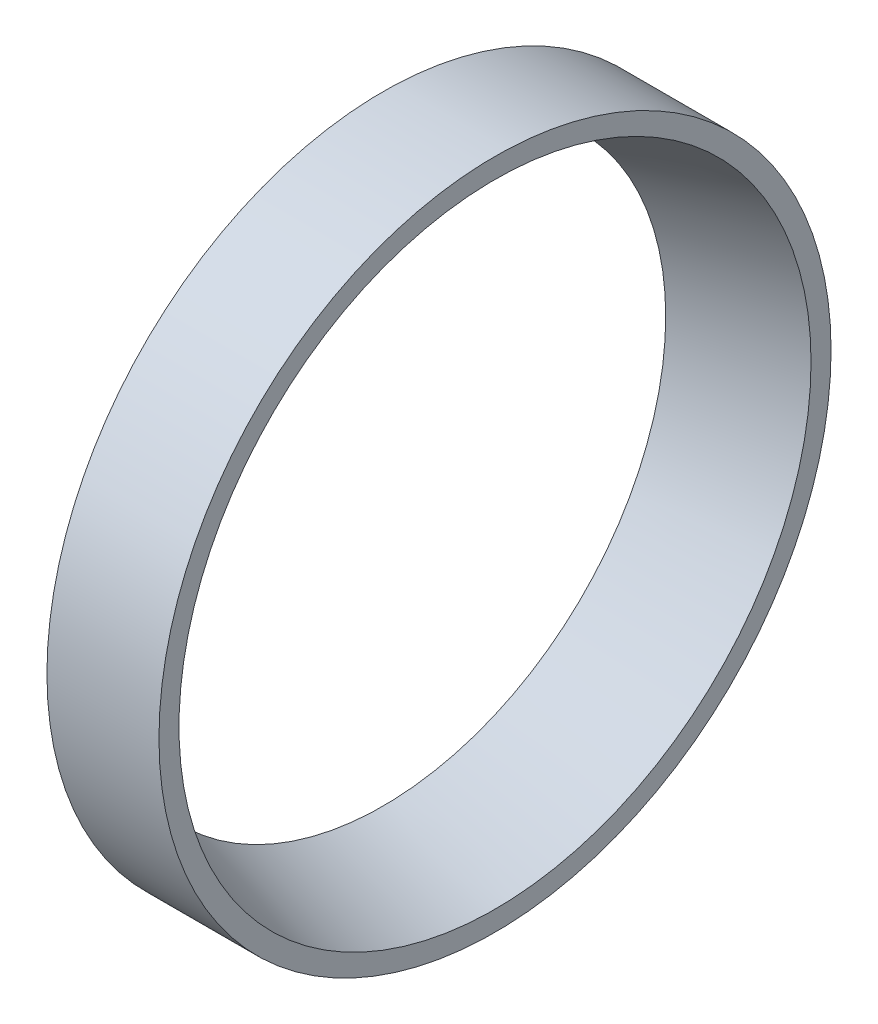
from build123d import *


with BuildPart() as part:
    # Esquisse1 → Base-R_volution (revolve)
    with BuildSketch(Plane.XY, mode=Mode.PRIVATE) as base_r_volution_sk:
        Polygon((0, 28.212), (0, 30), (-10, 30), (-10, 25.24), align=None)
    revolve(base_r_volution_sk.sketch.rotate(Axis((40, 0, 0), (-1, 0, 0)), 90), axis=Axis((40, 0, 0), (-1, 0, 0)))


solid = part.part
